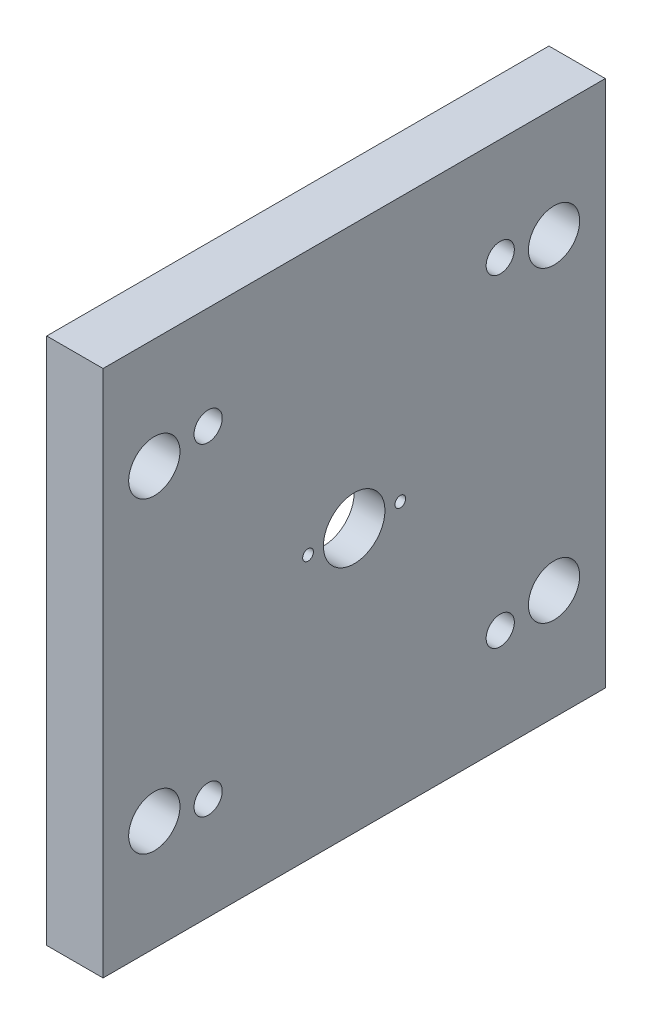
ISO-10303-21;
HEADER;
FILE_DESCRIPTION(('STEP AP214'),'2;1');
FILE_NAME('part.step','',(''),(''),'','','');
FILE_SCHEMA(('AUTOMOTIVE_DESIGN { 1 0 10303 214 1 1 1 1 }'));
ENDSEC;
DATA;
#1=APPLICATION_CONTEXT('core data for automotive mechanical design processes');
#2=APPLICATION_PROTOCOL_DEFINITION('international standard','automotive_design',2000,#1);
#3=PRODUCT_CONTEXT('',#1,'mechanical');
#4=PRODUCT('Part','Part','',(#3));
#5=PRODUCT_RELATED_PRODUCT_CATEGORY('part','',(#4));
#6=PRODUCT_DEFINITION_FORMATION('','',#4);
#7=PRODUCT_DEFINITION_CONTEXT('part definition',#1,'design');
#8=PRODUCT_DEFINITION('design','',#6,#7);
#9=PRODUCT_DEFINITION_SHAPE('','',#8);
#10=(LENGTH_UNIT() NAMED_UNIT(*) SI_UNIT(.MILLI.,.METRE.));
#11=(NAMED_UNIT(*) PLANE_ANGLE_UNIT() SI_UNIT($,.RADIAN.));
#12=(NAMED_UNIT(*) SI_UNIT($,.STERADIAN.) SOLID_ANGLE_UNIT());
#13=UNCERTAINTY_MEASURE_WITH_UNIT(LENGTH_MEASURE(1.E-05),#10,'distance_accuracy_value','');
#14=(GEOMETRIC_REPRESENTATION_CONTEXT(3) GLOBAL_UNCERTAINTY_ASSIGNED_CONTEXT((#13)) GLOBAL_UNIT_ASSIGNED_CONTEXT((#10,
#11,#12)) REPRESENTATION_CONTEXT('',''));
#15=CARTESIAN_POINT('',(0.,0.,0.));
#16=DIRECTION('',(0.,0.,1.));
#17=DIRECTION('',(1.,0.,0.));
#18=AXIS2_PLACEMENT_3D('',#15,#16,#17);
#19=CARTESIAN_POINT('',(0.,0.,0.));
#20=DIRECTION('',(-1.,0.,0.));
#21=DIRECTION('',(0.,0.,1.));
#22=AXIS2_PLACEMENT_3D('',#19,#20,#21);
#23=CYLINDRICAL_SURFACE('',#22,12.);
#24=CARTESIAN_POINT('',(0.,0.,0.));
#25=DIRECTION('',(-1.,0.,0.));
#26=DIRECTION('',(0.,0.,1.));
#27=AXIS2_PLACEMENT_3D('',#24,#25,#26);
#28=CIRCLE('',#27,12.);
#29=CARTESIAN_POINT('',(0.,0.,12.));
#30=VERTEX_POINT('',#29);
#31=EDGE_CURVE('E131',#30,#30,#28,.T.);
#32=ORIENTED_EDGE('',*,*,#31,.F.);
#33=EDGE_LOOP('',(#32));
#34=FACE_BOUND('',#33,.T.);
#35=CARTESIAN_POINT('',(-12.,0.,0.));
#36=DIRECTION('',(-1.,0.,0.));
#37=DIRECTION('',(0.,0.,1.));
#38=AXIS2_PLACEMENT_3D('',#35,#36,#37);
#39=CIRCLE('',#38,12.);
#40=CARTESIAN_POINT('',(-12.,0.,12.));
#41=VERTEX_POINT('',#40);
#42=EDGE_CURVE('E124',#41,#41,#39,.F.);
#43=ORIENTED_EDGE('',*,*,#42,.F.);
#44=EDGE_LOOP('',(#43));
#45=FACE_BOUND('',#44,.T.);
#46=ADVANCED_FACE('F42',(#34,#45),#23,.F.);
#47=CARTESIAN_POINT('',(0.,0.,0.));
#48=DIRECTION('',(1.,0.,0.));
#49=DIRECTION('',(0.,0.,-1.));
#50=AXIS2_PLACEMENT_3D('',#47,#48,#49);
#51=PLANE('',#50);
#52=CARTESIAN_POINT('',(0.,-0.000611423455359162,-17.9999999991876));
#53=DIRECTION('',(1.,0.,0.));
#54=DIRECTION('',(0.,0.,-1.));
#55=AXIS2_PLACEMENT_3D('',#52,#53,#54);
#56=CIRCLE('',#55,2.09999999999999);
#57=CARTESIAN_POINT('',(0.,-0.000611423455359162,-20.0999999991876));
#58=VERTEX_POINT('',#57);
#59=EDGE_CURVE('E142',#58,#58,#56,.T.);
#60=ORIENTED_EDGE('',*,*,#59,.F.);
#61=EDGE_LOOP('',(#60));
#62=FACE_BOUND('',#61,.T.);
#63=CARTESIAN_POINT('',(0.,0.00144159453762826,17.9999999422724));
#64=DIRECTION('',(1.,0.,0.));
#65=DIRECTION('',(0.,0.,-1.));
#66=AXIS2_PLACEMENT_3D('',#63,#64,#65);
#67=CIRCLE('',#66,2.09999999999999);
#68=CARTESIAN_POINT('',(0.,0.00144159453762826,15.8999999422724));
#69=VERTEX_POINT('',#68);
#70=EDGE_CURVE('E163',#69,#69,#67,.T.);
#71=ORIENTED_EDGE('',*,*,#70,.F.);
#72=EDGE_LOOP('',(#71));
#73=FACE_BOUND('',#72,.T.);
#74=ORIENTED_EDGE('',*,*,#31,.T.);
#75=EDGE_LOOP('',(#74));
#76=FACE_BOUND('',#75,.T.);
#77=DIRECTION('',(0.,0.,-1.));
#78=VECTOR('',#77,1.);
#79=CARTESIAN_POINT('',(0.,-103.,0.));
#80=LINE('',#79,#78);
#81=CARTESIAN_POINT('',(0.,-103.,98.));
#82=VERTEX_POINT('',#81);
#83=CARTESIAN_POINT('',(0.,-103.,-98.));
#84=VERTEX_POINT('',#83);
#85=EDGE_CURVE('E11',#82,#84,#80,.T.);
#86=ORIENTED_EDGE('',*,*,#85,.T.);
#87=DIRECTION('',(0.,-1.,0.));
#88=VECTOR('',#87,1.);
#89=CARTESIAN_POINT('',(0.,0.,-98.));
#90=LINE('',#89,#88);
#91=CARTESIAN_POINT('',(0.,103.,-98.));
#92=VERTEX_POINT('',#91);
#93=EDGE_CURVE('E62',#92,#84,#90,.T.);
#94=ORIENTED_EDGE('',*,*,#93,.F.);
#95=DIRECTION('',(0.,0.,-1.));
#96=VECTOR('',#95,1.);
#97=CARTESIAN_POINT('',(0.,103.,0.));
#98=LINE('',#97,#96);
#99=CARTESIAN_POINT('',(0.,103.,98.));
#100=VERTEX_POINT('',#99);
#101=EDGE_CURVE('E104',#100,#92,#98,.T.);
#102=ORIENTED_EDGE('',*,*,#101,.F.);
#103=DIRECTION('',(0.,1.,0.));
#104=VECTOR('',#103,1.);
#105=CARTESIAN_POINT('',(0.,0.,98.));
#106=LINE('',#105,#104);
#107=EDGE_CURVE('E91',#82,#100,#106,.T.);
#108=ORIENTED_EDGE('',*,*,#107,.F.);
#109=EDGE_LOOP('',(#86,#94,#102,#108));
#110=FACE_BOUND('',#109,.T.);
#111=CARTESIAN_POINT('',(0.,60.,-78.));
#112=DIRECTION('',(-1.,0.,0.));
#113=DIRECTION('',(0.,0.,-1.));
#114=AXIS2_PLACEMENT_3D('',#111,#112,#113);
#115=CIRCLE('',#114,10.);
#116=CARTESIAN_POINT('',(0.,60.,-88.));
#117=VERTEX_POINT('',#116);
#118=EDGE_CURVE('E53',#117,#117,#115,.T.);
#119=ORIENTED_EDGE('',*,*,#118,.T.);
#120=EDGE_LOOP('',(#119));
#121=FACE_BOUND('',#120,.T.);
#122=CARTESIAN_POINT('',(0.,60.,78.));
#123=DIRECTION('',(-1.,0.,0.));
#124=DIRECTION('',(0.,0.,-1.));
#125=AXIS2_PLACEMENT_3D('',#122,#123,#124);
#126=CIRCLE('',#125,10.);
#127=CARTESIAN_POINT('',(0.,60.,68.));
#128=VERTEX_POINT('',#127);
#129=EDGE_CURVE('E218',#128,#128,#126,.T.);
#130=ORIENTED_EDGE('',*,*,#129,.T.);
#131=EDGE_LOOP('',(#130));
#132=FACE_BOUND('',#131,.T.);
#133=CARTESIAN_POINT('',(0.,-60.,78.));
#134=DIRECTION('',(-1.,0.,0.));
#135=DIRECTION('',(0.,0.,-1.));
#136=AXIS2_PLACEMENT_3D('',#133,#134,#135);
#137=CIRCLE('',#136,10.);
#138=CARTESIAN_POINT('',(0.,-60.,68.));
#139=VERTEX_POINT('',#138);
#140=EDGE_CURVE('E178',#139,#139,#137,.T.);
#141=ORIENTED_EDGE('',*,*,#140,.T.);
#142=EDGE_LOOP('',(#141));
#143=FACE_BOUND('',#142,.T.);
#144=CARTESIAN_POINT('',(0.,-60.,-78.));
#145=DIRECTION('',(-1.,0.,0.));
#146=DIRECTION('',(0.,0.,-1.));
#147=AXIS2_PLACEMENT_3D('',#144,#145,#146);
#148=CIRCLE('',#147,10.);
#149=CARTESIAN_POINT('',(0.,-60.,-88.));
#150=VERTEX_POINT('',#149);
#151=EDGE_CURVE('E174',#150,#150,#148,.T.);
#152=ORIENTED_EDGE('',*,*,#151,.T.);
#153=EDGE_LOOP('',(#152));
#154=FACE_BOUND('',#153,.T.);
#155=CARTESIAN_POINT('',(0.,63.,-57.));
#156=DIRECTION('',(-1.,0.,0.));
#157=DIRECTION('',(0.,0.,-1.));
#158=AXIS2_PLACEMENT_3D('',#155,#156,#157);
#159=CIRCLE('',#158,5.5);
#160=CARTESIAN_POINT('',(0.,63.,-62.5));
#161=VERTEX_POINT('',#160);
#162=EDGE_CURVE('E179',#161,#161,#159,.T.);
#163=ORIENTED_EDGE('',*,*,#162,.T.);
#164=EDGE_LOOP('',(#163));
#165=FACE_BOUND('',#164,.T.);
#166=CARTESIAN_POINT('',(0.,63.,57.));
#167=DIRECTION('',(-1.,0.,0.));
#168=DIRECTION('',(0.,0.,-1.));
#169=AXIS2_PLACEMENT_3D('',#166,#167,#168);
#170=CIRCLE('',#169,5.5);
#171=CARTESIAN_POINT('',(0.,63.,51.5));
#172=VERTEX_POINT('',#171);
#173=EDGE_CURVE('E192',#172,#172,#170,.T.);
#174=ORIENTED_EDGE('',*,*,#173,.T.);
#175=EDGE_LOOP('',(#174));
#176=FACE_BOUND('',#175,.T.);
#177=CARTESIAN_POINT('',(0.,-63.,57.));
#178=DIRECTION('',(-1.,0.,0.));
#179=DIRECTION('',(0.,0.,-1.));
#180=AXIS2_PLACEMENT_3D('',#177,#178,#179);
#181=CIRCLE('',#180,5.5);
#182=CARTESIAN_POINT('',(0.,-63.,51.5));
#183=VERTEX_POINT('',#182);
#184=EDGE_CURVE('E256',#183,#183,#181,.T.);
#185=ORIENTED_EDGE('',*,*,#184,.T.);
#186=EDGE_LOOP('',(#185));
#187=FACE_BOUND('',#186,.T.);
#188=CARTESIAN_POINT('',(0.,-63.,-57.));
#189=DIRECTION('',(-1.,0.,0.));
#190=DIRECTION('',(0.,0.,-1.));
#191=AXIS2_PLACEMENT_3D('',#188,#189,#190);
#192=CIRCLE('',#191,5.5);
#193=CARTESIAN_POINT('',(0.,-63.,-62.5));
#194=VERTEX_POINT('',#193);
#195=EDGE_CURVE('E253',#194,#194,#192,.T.);
#196=ORIENTED_EDGE('',*,*,#195,.T.);
#197=EDGE_LOOP('',(#196));
#198=FACE_BOUND('',#197,.T.);
#199=ADVANCED_FACE('F284',(#62,#73,#76,#110,#121,#132,#143,#154,#165,#176,#187,#198),#51,.T.);
#200=CARTESIAN_POINT('',(-11.,103.,0.));
#201=DIRECTION('',(0.,1.,0.));
#202=DIRECTION('',(0.,0.,1.));
#203=AXIS2_PLACEMENT_3D('',#200,#201,#202);
#204=PLANE('',#203);
#205=ORIENTED_EDGE('',*,*,#101,.T.);
#206=DIRECTION('',(1.,0.,0.));
#207=VECTOR('',#206,1.);
#208=CARTESIAN_POINT('',(-11.,103.,-98.));
#209=LINE('',#208,#207);
#210=CARTESIAN_POINT('',(-22.,103.,-98.));
#211=VERTEX_POINT('',#210);
#212=EDGE_CURVE('E101',#211,#92,#209,.T.);
#213=ORIENTED_EDGE('',*,*,#212,.F.);
#214=DIRECTION('',(0.,0.,-1.));
#215=VECTOR('',#214,1.);
#216=CARTESIAN_POINT('',(-22.,103.,0.));
#217=LINE('',#216,#215);
#218=CARTESIAN_POINT('',(-22.,103.,98.));
#219=VERTEX_POINT('',#218);
#220=EDGE_CURVE('E99',#219,#211,#217,.T.);
#221=ORIENTED_EDGE('',*,*,#220,.F.);
#222=DIRECTION('',(-1.,0.,0.));
#223=VECTOR('',#222,1.);
#224=CARTESIAN_POINT('',(-11.,103.,98.));
#225=LINE('',#224,#223);
#226=EDGE_CURVE('E84',#100,#219,#225,.T.);
#227=ORIENTED_EDGE('',*,*,#226,.F.);
#228=EDGE_LOOP('',(#205,#213,#221,#227));
#229=FACE_BOUND('',#228,.T.);
#230=ADVANCED_FACE('F100',(#229),#204,.T.);
#231=CARTESIAN_POINT('',(-22.,0.,0.));
#232=DIRECTION('',(-1.,0.,0.));
#233=DIRECTION('',(0.,0.,1.));
#234=AXIS2_PLACEMENT_3D('',#231,#232,#233);
#235=PLANE('',#234);
#236=ORIENTED_EDGE('',*,*,#220,.T.);
#237=DIRECTION('',(0.,1.,0.));
#238=VECTOR('',#237,1.);
#239=CARTESIAN_POINT('',(-22.,0.,-98.));
#240=LINE('',#239,#238);
#241=CARTESIAN_POINT('',(-22.,-103.,-98.));
#242=VERTEX_POINT('',#241);
#243=EDGE_CURVE('E245',#242,#211,#240,.T.);
#244=ORIENTED_EDGE('',*,*,#243,.F.);
#245=DIRECTION('',(0.,0.,-1.));
#246=VECTOR('',#245,1.);
#247=CARTESIAN_POINT('',(-22.,-103.,0.));
#248=LINE('',#247,#246);
#249=CARTESIAN_POINT('',(-22.,-103.,98.));
#250=VERTEX_POINT('',#249);
#251=EDGE_CURVE('E111',#250,#242,#248,.T.);
#252=ORIENTED_EDGE('',*,*,#251,.F.);
#253=DIRECTION('',(0.,-1.,0.));
#254=VECTOR('',#253,1.);
#255=CARTESIAN_POINT('',(-22.,0.,98.));
#256=LINE('',#255,#254);
#257=EDGE_CURVE('E89',#219,#250,#256,.T.);
#258=ORIENTED_EDGE('',*,*,#257,.F.);
#259=EDGE_LOOP('',(#236,#244,#252,#258));
#260=FACE_BOUND('',#259,.T.);
#261=CARTESIAN_POINT('',(-22.,60.,-78.));
#262=DIRECTION('',(1.,0.,0.));
#263=DIRECTION('',(0.,0.,-1.));
#264=AXIS2_PLACEMENT_3D('',#261,#262,#263);
#265=CIRCLE('',#264,10.);
#266=CARTESIAN_POINT('',(-22.,60.,-88.));
#267=VERTEX_POINT('',#266);
#268=EDGE_CURVE('E105',#267,#267,#265,.T.);
#269=ORIENTED_EDGE('',*,*,#268,.T.);
#270=EDGE_LOOP('',(#269));
#271=FACE_BOUND('',#270,.T.);
#272=CARTESIAN_POINT('',(-22.,60.,78.));
#273=DIRECTION('',(1.,0.,0.));
#274=DIRECTION('',(0.,0.,-1.));
#275=AXIS2_PLACEMENT_3D('',#272,#273,#274);
#276=CIRCLE('',#275,10.);
#277=CARTESIAN_POINT('',(-22.,60.,68.));
#278=VERTEX_POINT('',#277);
#279=EDGE_CURVE('E187',#278,#278,#276,.T.);
#280=ORIENTED_EDGE('',*,*,#279,.T.);
#281=EDGE_LOOP('',(#280));
#282=FACE_BOUND('',#281,.T.);
#283=CARTESIAN_POINT('',(-22.,-60.,78.));
#284=DIRECTION('',(1.,0.,0.));
#285=DIRECTION('',(0.,0.,-1.));
#286=AXIS2_PLACEMENT_3D('',#283,#284,#285);
#287=CIRCLE('',#286,10.);
#288=CARTESIAN_POINT('',(-22.,-60.,68.));
#289=VERTEX_POINT('',#288);
#290=EDGE_CURVE('E214',#289,#289,#287,.T.);
#291=ORIENTED_EDGE('',*,*,#290,.T.);
#292=EDGE_LOOP('',(#291));
#293=FACE_BOUND('',#292,.T.);
#294=CARTESIAN_POINT('',(-22.,-60.,-78.));
#295=DIRECTION('',(1.,0.,0.));
#296=DIRECTION('',(0.,0.,-1.));
#297=AXIS2_PLACEMENT_3D('',#294,#295,#296);
#298=CIRCLE('',#297,10.);
#299=CARTESIAN_POINT('',(-22.,-60.,-88.));
#300=VERTEX_POINT('',#299);
#301=EDGE_CURVE('E207',#300,#300,#298,.T.);
#302=ORIENTED_EDGE('',*,*,#301,.T.);
#303=EDGE_LOOP('',(#302));
#304=FACE_BOUND('',#303,.T.);
#305=CARTESIAN_POINT('',(-22.,63.,-57.));
#306=DIRECTION('',(1.,0.,0.));
#307=DIRECTION('',(0.,0.,-1.));
#308=AXIS2_PLACEMENT_3D('',#305,#306,#307);
#309=CIRCLE('',#308,9.);
#310=CARTESIAN_POINT('',(-22.,63.,-66.));
#311=VERTEX_POINT('',#310);
#312=EDGE_CURVE('E203',#311,#311,#309,.T.);
#313=ORIENTED_EDGE('',*,*,#312,.T.);
#314=EDGE_LOOP('',(#313));
#315=FACE_BOUND('',#314,.T.);
#316=CARTESIAN_POINT('',(-22.,63.,57.));
#317=DIRECTION('',(1.,0.,0.));
#318=DIRECTION('',(0.,0.,-1.));
#319=AXIS2_PLACEMENT_3D('',#316,#317,#318);
#320=CIRCLE('',#319,9.);
#321=CARTESIAN_POINT('',(-22.,63.,48.));
#322=VERTEX_POINT('',#321);
#323=EDGE_CURVE('E199',#322,#322,#320,.T.);
#324=ORIENTED_EDGE('',*,*,#323,.T.);
#325=EDGE_LOOP('',(#324));
#326=FACE_BOUND('',#325,.T.);
#327=CARTESIAN_POINT('',(-22.,-63.,57.));
#328=DIRECTION('',(1.,0.,0.));
#329=DIRECTION('',(0.,0.,-1.));
#330=AXIS2_PLACEMENT_3D('',#327,#328,#329);
#331=CIRCLE('',#330,9.);
#332=CARTESIAN_POINT('',(-22.,-63.,48.));
#333=VERTEX_POINT('',#332);
#334=EDGE_CURVE('E197',#333,#333,#331,.T.);
#335=ORIENTED_EDGE('',*,*,#334,.T.);
#336=EDGE_LOOP('',(#335));
#337=FACE_BOUND('',#336,.T.);
#338=CARTESIAN_POINT('',(-22.,-63.,-57.));
#339=DIRECTION('',(1.,0.,0.));
#340=DIRECTION('',(0.,0.,-1.));
#341=AXIS2_PLACEMENT_3D('',#338,#339,#340);
#342=CIRCLE('',#341,9.);
#343=CARTESIAN_POINT('',(-22.,-63.,-66.));
#344=VERTEX_POINT('',#343);
#345=EDGE_CURVE('E193',#344,#344,#342,.T.);
#346=ORIENTED_EDGE('',*,*,#345,.T.);
#347=EDGE_LOOP('',(#346));
#348=FACE_BOUND('',#347,.T.);
#349=CARTESIAN_POINT('',(-22.,0.,0.));
#350=DIRECTION('',(1.,0.,0.));
#351=DIRECTION('',(0.,0.,-1.));
#352=AXIS2_PLACEMENT_3D('',#349,#350,#351);
#353=CIRCLE('',#352,45.);
#354=CARTESIAN_POINT('',(-22.,0.,-45.));
#355=VERTEX_POINT('',#354);
#356=EDGE_CURVE('E198',#355,#355,#353,.T.);
#357=ORIENTED_EDGE('',*,*,#356,.T.);
#358=EDGE_LOOP('',(#357));
#359=FACE_BOUND('',#358,.T.);
#360=ADVANCED_FACE('F108',(#260,#271,#282,#293,#304,#315,#326,#337,#348,#359),#235,.T.);
#361=CARTESIAN_POINT('',(-11.,-103.,0.));
#362=DIRECTION('',(0.,-1.,0.));
#363=DIRECTION('',(0.,0.,-1.));
#364=AXIS2_PLACEMENT_3D('',#361,#362,#363);
#365=PLANE('',#364);
#366=ORIENTED_EDGE('',*,*,#251,.T.);
#367=DIRECTION('',(-1.,0.,0.));
#368=VECTOR('',#367,1.);
#369=CARTESIAN_POINT('',(-11.,-103.,-98.));
#370=LINE('',#369,#368);
#371=EDGE_CURVE('E248',#84,#242,#370,.T.);
#372=ORIENTED_EDGE('',*,*,#371,.F.);
#373=ORIENTED_EDGE('',*,*,#85,.F.);
#374=DIRECTION('',(1.,0.,0.));
#375=VECTOR('',#374,1.);
#376=CARTESIAN_POINT('',(-11.,-103.,98.));
#377=LINE('',#376,#375);
#378=EDGE_CURVE('E113',#250,#82,#377,.T.);
#379=ORIENTED_EDGE('',*,*,#378,.F.);
#380=EDGE_LOOP('',(#366,#372,#373,#379));
#381=FACE_BOUND('',#380,.T.);
#382=ADVANCED_FACE('F332',(#381),#365,.T.);
#383=CARTESIAN_POINT('',(-11.,0.,-98.));
#384=DIRECTION('',(0.,0.,-1.));
#385=DIRECTION('',(-1.,0.,0.));
#386=AXIS2_PLACEMENT_3D('',#383,#384,#385);
#387=PLANE('',#386);
#388=ORIENTED_EDGE('',*,*,#93,.T.);
#389=ORIENTED_EDGE('',*,*,#371,.T.);
#390=ORIENTED_EDGE('',*,*,#243,.T.);
#391=ORIENTED_EDGE('',*,*,#212,.T.);
#392=EDGE_LOOP('',(#388,#389,#390,#391));
#393=FACE_BOUND('',#392,.T.);
#394=ADVANCED_FACE('F335',(#393),#387,.T.);
#395=CARTESIAN_POINT('',(-11.,0.,98.));
#396=DIRECTION('',(0.,0.,1.));
#397=DIRECTION('',(1.,0.,0.));
#398=AXIS2_PLACEMENT_3D('',#395,#396,#397);
#399=PLANE('',#398);
#400=ORIENTED_EDGE('',*,*,#107,.T.);
#401=ORIENTED_EDGE('',*,*,#226,.T.);
#402=ORIENTED_EDGE('',*,*,#257,.T.);
#403=ORIENTED_EDGE('',*,*,#378,.T.);
#404=EDGE_LOOP('',(#400,#401,#402,#403));
#405=FACE_BOUND('',#404,.T.);
#406=ADVANCED_FACE('F86',(#405),#399,.T.);
#407=CARTESIAN_POINT('',(-11.,60.,-78.));
#408=DIRECTION('',(-1.,0.,0.));
#409=DIRECTION('',(0.,0.,1.));
#410=AXIS2_PLACEMENT_3D('',#407,#408,#409);
#411=CYLINDRICAL_SURFACE('',#410,10.);
#412=ORIENTED_EDGE('',*,*,#118,.F.);
#413=EDGE_LOOP('',(#412));
#414=FACE_BOUND('',#413,.T.);
#415=ORIENTED_EDGE('',*,*,#268,.F.);
#416=EDGE_LOOP('',(#415));
#417=FACE_BOUND('',#416,.T.);
#418=ADVANCED_FACE('F340',(#414,#417),#411,.F.);
#419=CARTESIAN_POINT('',(-11.,60.,78.));
#420=DIRECTION('',(-1.,0.,0.));
#421=DIRECTION('',(0.,0.,1.));
#422=AXIS2_PLACEMENT_3D('',#419,#420,#421);
#423=CYLINDRICAL_SURFACE('',#422,10.);
#424=ORIENTED_EDGE('',*,*,#129,.F.);
#425=EDGE_LOOP('',(#424));
#426=FACE_BOUND('',#425,.T.);
#427=ORIENTED_EDGE('',*,*,#279,.F.);
#428=EDGE_LOOP('',(#427));
#429=FACE_BOUND('',#428,.T.);
#430=ADVANCED_FACE('F542',(#426,#429),#423,.F.);
#431=CARTESIAN_POINT('',(-11.,-60.,78.));
#432=DIRECTION('',(-1.,0.,0.));
#433=DIRECTION('',(0.,0.,1.));
#434=AXIS2_PLACEMENT_3D('',#431,#432,#433);
#435=CYLINDRICAL_SURFACE('',#434,10.);
#436=ORIENTED_EDGE('',*,*,#140,.F.);
#437=EDGE_LOOP('',(#436));
#438=FACE_BOUND('',#437,.T.);
#439=ORIENTED_EDGE('',*,*,#290,.F.);
#440=EDGE_LOOP('',(#439));
#441=FACE_BOUND('',#440,.T.);
#442=ADVANCED_FACE('F360',(#438,#441),#435,.F.);
#443=CARTESIAN_POINT('',(-11.,-60.,-78.));
#444=DIRECTION('',(-1.,0.,0.));
#445=DIRECTION('',(0.,0.,1.));
#446=AXIS2_PLACEMENT_3D('',#443,#444,#445);
#447=CYLINDRICAL_SURFACE('',#446,10.);
#448=ORIENTED_EDGE('',*,*,#151,.F.);
#449=EDGE_LOOP('',(#448));
#450=FACE_BOUND('',#449,.T.);
#451=ORIENTED_EDGE('',*,*,#301,.F.);
#452=EDGE_LOOP('',(#451));
#453=FACE_BOUND('',#452,.T.);
#454=ADVANCED_FACE('F354',(#450,#453),#447,.F.);
#455=CARTESIAN_POINT('',(-11.,63.,-57.));
#456=DIRECTION('',(-1.,0.,0.));
#457=DIRECTION('',(0.,0.,1.));
#458=AXIS2_PLACEMENT_3D('',#455,#456,#457);
#459=CYLINDRICAL_SURFACE('',#458,5.5);
#460=ORIENTED_EDGE('',*,*,#162,.F.);
#461=EDGE_LOOP('',(#460));
#462=FACE_BOUND('',#461,.T.);
#463=CARTESIAN_POINT('',(-9.,63.,-57.));
#464=DIRECTION('',(-1.,0.,0.));
#465=DIRECTION('',(0.,0.,-1.));
#466=AXIS2_PLACEMENT_3D('',#463,#464,#465);
#467=CIRCLE('',#466,5.5);
#468=CARTESIAN_POINT('',(-9.,63.,-62.5));
#469=VERTEX_POINT('',#468);
#470=EDGE_CURVE('E173',#469,#469,#467,.T.);
#471=ORIENTED_EDGE('',*,*,#470,.T.);
#472=EDGE_LOOP('',(#471));
#473=FACE_BOUND('',#472,.T.);
#474=ADVANCED_FACE('F291',(#462,#473),#459,.F.);
#475=CARTESIAN_POINT('',(-11.,63.,57.));
#476=DIRECTION('',(-1.,0.,0.));
#477=DIRECTION('',(0.,0.,1.));
#478=AXIS2_PLACEMENT_3D('',#475,#476,#477);
#479=CYLINDRICAL_SURFACE('',#478,5.5);
#480=ORIENTED_EDGE('',*,*,#173,.F.);
#481=EDGE_LOOP('',(#480));
#482=FACE_BOUND('',#481,.T.);
#483=CARTESIAN_POINT('',(-9.,63.,57.));
#484=DIRECTION('',(-1.,0.,0.));
#485=DIRECTION('',(0.,0.,-1.));
#486=AXIS2_PLACEMENT_3D('',#483,#484,#485);
#487=CIRCLE('',#486,5.5);
#488=CARTESIAN_POINT('',(-9.,63.,51.5));
#489=VERTEX_POINT('',#488);
#490=EDGE_CURVE('E180',#489,#489,#487,.T.);
#491=ORIENTED_EDGE('',*,*,#490,.T.);
#492=EDGE_LOOP('',(#491));
#493=FACE_BOUND('',#492,.T.);
#494=ADVANCED_FACE('F287',(#482,#493),#479,.F.);
#495=CARTESIAN_POINT('',(-11.,-63.,57.));
#496=DIRECTION('',(-1.,0.,0.));
#497=DIRECTION('',(0.,0.,1.));
#498=AXIS2_PLACEMENT_3D('',#495,#496,#497);
#499=CYLINDRICAL_SURFACE('',#498,5.5);
#500=ORIENTED_EDGE('',*,*,#184,.F.);
#501=EDGE_LOOP('',(#500));
#502=FACE_BOUND('',#501,.T.);
#503=CARTESIAN_POINT('',(-9.,-63.,57.));
#504=DIRECTION('',(-1.,0.,0.));
#505=DIRECTION('',(0.,0.,-1.));
#506=AXIS2_PLACEMENT_3D('',#503,#504,#505);
#507=CIRCLE('',#506,5.5);
#508=CARTESIAN_POINT('',(-9.,-63.,51.5));
#509=VERTEX_POINT('',#508);
#510=EDGE_CURVE('E118',#509,#509,#507,.T.);
#511=ORIENTED_EDGE('',*,*,#510,.T.);
#512=EDGE_LOOP('',(#511));
#513=FACE_BOUND('',#512,.T.);
#514=ADVANCED_FACE('F290',(#502,#513),#499,.F.);
#515=CARTESIAN_POINT('',(-11.,-63.,-57.));
#516=DIRECTION('',(-1.,0.,0.));
#517=DIRECTION('',(0.,0.,1.));
#518=AXIS2_PLACEMENT_3D('',#515,#516,#517);
#519=CYLINDRICAL_SURFACE('',#518,5.5);
#520=ORIENTED_EDGE('',*,*,#195,.F.);
#521=EDGE_LOOP('',(#520));
#522=FACE_BOUND('',#521,.T.);
#523=CARTESIAN_POINT('',(-9.,-63.,-57.));
#524=DIRECTION('',(-1.,0.,0.));
#525=DIRECTION('',(0.,0.,-1.));
#526=AXIS2_PLACEMENT_3D('',#523,#524,#525);
#527=CIRCLE('',#526,5.5);
#528=CARTESIAN_POINT('',(-9.,-63.,-62.5));
#529=VERTEX_POINT('',#528);
#530=EDGE_CURVE('E184',#529,#529,#527,.T.);
#531=ORIENTED_EDGE('',*,*,#530,.T.);
#532=EDGE_LOOP('',(#531));
#533=FACE_BOUND('',#532,.T.);
#534=ADVANCED_FACE('F342',(#522,#533),#519,.F.);
#535=CARTESIAN_POINT('',(-9.,63.,-57.));
#536=DIRECTION('',(-1.,0.,0.));
#537=DIRECTION('',(0.,0.,1.));
#538=AXIS2_PLACEMENT_3D('',#535,#536,#537);
#539=PLANE('',#538);
#540=CARTESIAN_POINT('',(-9.,63.,-57.));
#541=DIRECTION('',(1.,0.,0.));
#542=DIRECTION('',(0.,0.,-1.));
#543=AXIS2_PLACEMENT_3D('',#540,#541,#542);
#544=CIRCLE('',#543,9.);
#545=CARTESIAN_POINT('',(-9.,63.,-66.));
#546=VERTEX_POINT('',#545);
#547=EDGE_CURVE('E230',#546,#546,#544,.T.);
#548=ORIENTED_EDGE('',*,*,#547,.F.);
#549=EDGE_LOOP('',(#548));
#550=FACE_BOUND('',#549,.T.);
#551=ORIENTED_EDGE('',*,*,#470,.F.);
#552=EDGE_LOOP('',(#551));
#553=FACE_BOUND('',#552,.T.);
#554=ADVANCED_FACE('F308',(#550,#553),#539,.T.);
#555=CARTESIAN_POINT('',(-15.5,63.,-57.));
#556=DIRECTION('',(-1.,0.,0.));
#557=DIRECTION('',(0.,0.,1.));
#558=AXIS2_PLACEMENT_3D('',#555,#556,#557);
#559=CYLINDRICAL_SURFACE('',#558,9.);
#560=ORIENTED_EDGE('',*,*,#547,.T.);
#561=EDGE_LOOP('',(#560));
#562=FACE_BOUND('',#561,.T.);
#563=ORIENTED_EDGE('',*,*,#312,.F.);
#564=EDGE_LOOP('',(#563));
#565=FACE_BOUND('',#564,.T.);
#566=ADVANCED_FACE('F298',(#562,#565),#559,.F.);
#567=CARTESIAN_POINT('',(-9.,63.,57.));
#568=DIRECTION('',(-1.,0.,0.));
#569=DIRECTION('',(0.,0.,1.));
#570=AXIS2_PLACEMENT_3D('',#567,#568,#569);
#571=PLANE('',#570);
#572=CARTESIAN_POINT('',(-9.,63.,57.));
#573=DIRECTION('',(1.,0.,0.));
#574=DIRECTION('',(0.,0.,-1.));
#575=AXIS2_PLACEMENT_3D('',#572,#573,#574);
#576=CIRCLE('',#575,9.);
#577=CARTESIAN_POINT('',(-9.,63.,48.));
#578=VERTEX_POINT('',#577);
#579=EDGE_CURVE('E226',#578,#578,#576,.T.);
#580=ORIENTED_EDGE('',*,*,#579,.F.);
#581=EDGE_LOOP('',(#580));
#582=FACE_BOUND('',#581,.T.);
#583=ORIENTED_EDGE('',*,*,#490,.F.);
#584=EDGE_LOOP('',(#583));
#585=FACE_BOUND('',#584,.T.);
#586=ADVANCED_FACE('F295',(#582,#585),#571,.T.);
#587=CARTESIAN_POINT('',(-15.5,63.,57.));
#588=DIRECTION('',(-1.,0.,0.));
#589=DIRECTION('',(0.,0.,1.));
#590=AXIS2_PLACEMENT_3D('',#587,#588,#589);
#591=CYLINDRICAL_SURFACE('',#590,9.);
#592=ORIENTED_EDGE('',*,*,#579,.T.);
#593=EDGE_LOOP('',(#592));
#594=FACE_BOUND('',#593,.T.);
#595=ORIENTED_EDGE('',*,*,#323,.F.);
#596=EDGE_LOOP('',(#595));
#597=FACE_BOUND('',#596,.T.);
#598=ADVANCED_FACE('F297',(#594,#597),#591,.F.);
#599=CARTESIAN_POINT('',(-9.,-63.,57.));
#600=DIRECTION('',(-1.,0.,0.));
#601=DIRECTION('',(0.,0.,1.));
#602=AXIS2_PLACEMENT_3D('',#599,#600,#601);
#603=PLANE('',#602);
#604=CARTESIAN_POINT('',(-9.,-63.,57.));
#605=DIRECTION('',(1.,0.,0.));
#606=DIRECTION('',(0.,0.,-1.));
#607=AXIS2_PLACEMENT_3D('',#604,#605,#606);
#608=CIRCLE('',#607,9.);
#609=CARTESIAN_POINT('',(-9.,-63.,48.));
#610=VERTEX_POINT('',#609);
#611=EDGE_CURVE('E231',#610,#610,#608,.T.);
#612=ORIENTED_EDGE('',*,*,#611,.F.);
#613=EDGE_LOOP('',(#612));
#614=FACE_BOUND('',#613,.T.);
#615=ORIENTED_EDGE('',*,*,#510,.F.);
#616=EDGE_LOOP('',(#615));
#617=FACE_BOUND('',#616,.T.);
#618=ADVANCED_FACE('F305',(#614,#617),#603,.T.);
#619=CARTESIAN_POINT('',(-15.5,-63.,57.));
#620=DIRECTION('',(-1.,0.,0.));
#621=DIRECTION('',(0.,0.,1.));
#622=AXIS2_PLACEMENT_3D('',#619,#620,#621);
#623=CYLINDRICAL_SURFACE('',#622,9.);
#624=ORIENTED_EDGE('',*,*,#611,.T.);
#625=EDGE_LOOP('',(#624));
#626=FACE_BOUND('',#625,.T.);
#627=ORIENTED_EDGE('',*,*,#334,.F.);
#628=EDGE_LOOP('',(#627));
#629=FACE_BOUND('',#628,.T.);
#630=ADVANCED_FACE('F369',(#626,#629),#623,.F.);
#631=CARTESIAN_POINT('',(-9.,-63.,-57.));
#632=DIRECTION('',(-1.,0.,0.));
#633=DIRECTION('',(0.,0.,1.));
#634=AXIS2_PLACEMENT_3D('',#631,#632,#633);
#635=PLANE('',#634);
#636=CARTESIAN_POINT('',(-9.,-63.,-57.));
#637=DIRECTION('',(1.,0.,0.));
#638=DIRECTION('',(0.,0.,-1.));
#639=AXIS2_PLACEMENT_3D('',#636,#637,#638);
#640=CIRCLE('',#639,9.);
#641=CARTESIAN_POINT('',(-9.,-63.,-66.));
#642=VERTEX_POINT('',#641);
#643=EDGE_CURVE('E235',#642,#642,#640,.T.);
#644=ORIENTED_EDGE('',*,*,#643,.F.);
#645=EDGE_LOOP('',(#644));
#646=FACE_BOUND('',#645,.T.);
#647=ORIENTED_EDGE('',*,*,#530,.F.);
#648=EDGE_LOOP('',(#647));
#649=FACE_BOUND('',#648,.T.);
#650=ADVANCED_FACE('F371',(#646,#649),#635,.T.);
#651=CARTESIAN_POINT('',(-15.5,-63.,-57.));
#652=DIRECTION('',(-1.,0.,0.));
#653=DIRECTION('',(0.,0.,1.));
#654=AXIS2_PLACEMENT_3D('',#651,#652,#653);
#655=CYLINDRICAL_SURFACE('',#654,9.);
#656=ORIENTED_EDGE('',*,*,#643,.T.);
#657=EDGE_LOOP('',(#656));
#658=FACE_BOUND('',#657,.T.);
#659=ORIENTED_EDGE('',*,*,#345,.F.);
#660=EDGE_LOOP('',(#659));
#661=FACE_BOUND('',#660,.T.);
#662=ADVANCED_FACE('F373',(#658,#661),#655,.F.);
#663=CARTESIAN_POINT('',(-17.95,0.,0.));
#664=DIRECTION('',(-1.,0.,0.));
#665=DIRECTION('',(0.,0.,1.));
#666=AXIS2_PLACEMENT_3D('',#663,#664,#665);
#667=PLANE('',#666);
#668=CARTESIAN_POINT('',(-17.95,0.,-40.));
#669=DIRECTION('',(-1.,0.,0.));
#670=DIRECTION('',(0.,0.,1.));
#671=AXIS2_PLACEMENT_3D('',#668,#669,#670);
#672=CIRCLE('',#671,2.09999999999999);
#673=CARTESIAN_POINT('',(-17.95,0.,-37.9));
#674=VERTEX_POINT('',#673);
#675=EDGE_CURVE('E46',#674,#674,#672,.T.);
#676=ORIENTED_EDGE('',*,*,#675,.F.);
#677=EDGE_LOOP('',(#676));
#678=FACE_BOUND('',#677,.T.);
#679=CARTESIAN_POINT('',(-17.95,0.,40.));
#680=DIRECTION('',(-1.,0.,0.));
#681=DIRECTION('',(0.,0.,1.));
#682=AXIS2_PLACEMENT_3D('',#679,#680,#681);
#683=CIRCLE('',#682,2.09999999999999);
#684=CARTESIAN_POINT('',(-17.95,0.,42.1));
#685=VERTEX_POINT('',#684);
#686=EDGE_CURVE('E132',#685,#685,#683,.T.);
#687=ORIENTED_EDGE('',*,*,#686,.F.);
#688=EDGE_LOOP('',(#687));
#689=FACE_BOUND('',#688,.T.);
#690=CARTESIAN_POINT('',(-17.95,0.,0.));
#691=DIRECTION('',(-1.,0.,0.));
#692=DIRECTION('',(0.,0.,1.));
#693=AXIS2_PLACEMENT_3D('',#690,#691,#692);
#694=CIRCLE('',#693,25.);
#695=CARTESIAN_POINT('',(-17.95,0.,25.));
#696=VERTEX_POINT('',#695);
#697=EDGE_CURVE('E128',#696,#696,#694,.T.);
#698=ORIENTED_EDGE('',*,*,#697,.F.);
#699=EDGE_LOOP('',(#698));
#700=FACE_BOUND('',#699,.T.);
#701=CARTESIAN_POINT('',(-17.95,0.,0.));
#702=DIRECTION('',(1.,0.,0.));
#703=DIRECTION('',(0.,0.,-1.));
#704=AXIS2_PLACEMENT_3D('',#701,#702,#703);
#705=CIRCLE('',#704,45.);
#706=CARTESIAN_POINT('',(-17.95,0.,-45.));
#707=VERTEX_POINT('',#706);
#708=EDGE_CURVE('E242',#707,#707,#705,.T.);
#709=ORIENTED_EDGE('',*,*,#708,.F.);
#710=EDGE_LOOP('',(#709));
#711=FACE_BOUND('',#710,.T.);
#712=ADVANCED_FACE('F375',(#678,#689,#700,#711),#667,.T.);
#713=CARTESIAN_POINT('',(-19.975,0.,0.));
#714=DIRECTION('',(-1.,0.,0.));
#715=DIRECTION('',(0.,0.,1.));
#716=AXIS2_PLACEMENT_3D('',#713,#714,#715);
#717=CYLINDRICAL_SURFACE('',#716,45.);
#718=ORIENTED_EDGE('',*,*,#708,.T.);
#719=EDGE_LOOP('',(#718));
#720=FACE_BOUND('',#719,.T.);
#721=ORIENTED_EDGE('',*,*,#356,.F.);
#722=EDGE_LOOP('',(#721));
#723=FACE_BOUND('',#722,.T.);
#724=ADVANCED_FACE('F44',(#720,#723),#717,.F.);
#725=CARTESIAN_POINT('',(-12.,0.,0.));
#726=DIRECTION('',(-1.,0.,0.));
#727=DIRECTION('',(0.,0.,1.));
#728=AXIS2_PLACEMENT_3D('',#725,#726,#727);
#729=PLANE('',#728);
#730=CARTESIAN_POINT('',(-12.,-0.000611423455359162,-17.9999999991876));
#731=DIRECTION('',(-1.,0.,0.));
#732=DIRECTION('',(0.,0.,1.));
#733=AXIS2_PLACEMENT_3D('',#730,#731,#732);
#734=CIRCLE('',#733,2.09999999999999);
#735=CARTESIAN_POINT('',(-12.,-0.000611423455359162,-15.8999999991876));
#736=VERTEX_POINT('',#735);
#737=EDGE_CURVE('E135',#736,#736,#734,.T.);
#738=ORIENTED_EDGE('',*,*,#737,.F.);
#739=EDGE_LOOP('',(#738));
#740=FACE_BOUND('',#739,.T.);
#741=CARTESIAN_POINT('',(-12.,0.00144159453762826,17.9999999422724));
#742=DIRECTION('',(-1.,0.,0.));
#743=DIRECTION('',(0.,0.,1.));
#744=AXIS2_PLACEMENT_3D('',#741,#742,#743);
#745=CIRCLE('',#744,2.09999999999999);
#746=CARTESIAN_POINT('',(-12.,0.00144159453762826,20.0999999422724));
#747=VERTEX_POINT('',#746);
#748=EDGE_CURVE('E159',#747,#747,#745,.T.);
#749=ORIENTED_EDGE('',*,*,#748,.F.);
#750=EDGE_LOOP('',(#749));
#751=FACE_BOUND('',#750,.T.);
#752=CARTESIAN_POINT('',(-12.,0.,0.));
#753=DIRECTION('',(-1.,0.,0.));
#754=DIRECTION('',(0.,0.,1.));
#755=AXIS2_PLACEMENT_3D('',#752,#753,#754);
#756=CIRCLE('',#755,25.);
#757=CARTESIAN_POINT('',(-12.,0.,25.));
#758=VERTEX_POINT('',#757);
#759=EDGE_CURVE('E129',#758,#758,#756,.T.);
#760=ORIENTED_EDGE('',*,*,#759,.T.);
#761=EDGE_LOOP('',(#760));
#762=FACE_BOUND('',#761,.T.);
#763=ORIENTED_EDGE('',*,*,#42,.T.);
#764=EDGE_LOOP('',(#763));
#765=FACE_BOUND('',#764,.T.);
#766=ADVANCED_FACE('F393',(#740,#751,#762,#765),#729,.T.);
#767=CARTESIAN_POINT('',(-12.,0.,0.));
#768=DIRECTION('',(-1.,0.,0.));
#769=DIRECTION('',(0.,0.,1.));
#770=AXIS2_PLACEMENT_3D('',#767,#768,#769);
#771=CYLINDRICAL_SURFACE('',#770,25.);
#772=ORIENTED_EDGE('',*,*,#697,.T.);
#773=EDGE_LOOP('',(#772));
#774=FACE_BOUND('',#773,.T.);
#775=ORIENTED_EDGE('',*,*,#759,.F.);
#776=EDGE_LOOP('',(#775));
#777=FACE_BOUND('',#776,.T.);
#778=ADVANCED_FACE('F325',(#774,#777),#771,.F.);
#779=CARTESIAN_POINT('',(-12.,0.00144159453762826,17.9999999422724));
#780=DIRECTION('',(-1.,0.,0.));
#781=DIRECTION('',(0.,0.,1.));
#782=AXIS2_PLACEMENT_3D('',#779,#780,#781);
#783=CYLINDRICAL_SURFACE('',#782,2.09999999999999);
#784=ORIENTED_EDGE('',*,*,#70,.T.);
#785=EDGE_LOOP('',(#784));
#786=FACE_BOUND('',#785,.T.);
#787=ORIENTED_EDGE('',*,*,#748,.T.);
#788=EDGE_LOOP('',(#787));
#789=FACE_BOUND('',#788,.T.);
#790=ADVANCED_FACE('F404',(#786,#789),#783,.F.);
#791=CARTESIAN_POINT('',(-12.,-0.000611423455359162,-17.9999999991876));
#792=DIRECTION('',(-1.,0.,0.));
#793=DIRECTION('',(0.,0.,1.));
#794=AXIS2_PLACEMENT_3D('',#791,#792,#793);
#795=CYLINDRICAL_SURFACE('',#794,2.09999999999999);
#796=ORIENTED_EDGE('',*,*,#59,.T.);
#797=EDGE_LOOP('',(#796));
#798=FACE_BOUND('',#797,.T.);
#799=ORIENTED_EDGE('',*,*,#737,.T.);
#800=EDGE_LOOP('',(#799));
#801=FACE_BOUND('',#800,.T.);
#802=ADVANCED_FACE('F411',(#798,#801),#795,.F.);
#803=CARTESIAN_POINT('',(-8.,0.,40.));
#804=DIRECTION('',(-1.,0.,0.));
#805=DIRECTION('',(0.,0.,1.));
#806=AXIS2_PLACEMENT_3D('',#803,#804,#805);
#807=CONICAL_SURFACE('',#806,2.09999999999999,1.02974425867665);
#808=CARTESIAN_POINT('',(-6.73819270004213,0.,40.));
#809=VERTEX_POINT('',#808);
#810=VERTEX_LOOP('',#809);
#811=FACE_BOUND('',#810,.T.);
#812=CARTESIAN_POINT('',(-8.,0.,40.));
#813=DIRECTION('',(-1.,0.,0.));
#814=DIRECTION('',(0.,0.,1.));
#815=AXIS2_PLACEMENT_3D('',#812,#813,#814);
#816=CIRCLE('',#815,2.09999999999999);
#817=CARTESIAN_POINT('',(-8.,0.,42.1));
#818=VERTEX_POINT('',#817);
#819=EDGE_CURVE('E136',#818,#818,#816,.T.);
#820=ORIENTED_EDGE('',*,*,#819,.T.);
#821=EDGE_LOOP('',(#820));
#822=FACE_BOUND('',#821,.T.);
#823=ADVANCED_FACE('F415',(#811,#822),#807,.F.);
#824=CARTESIAN_POINT('',(-22.,0.,40.));
#825=DIRECTION('',(-1.,0.,0.));
#826=DIRECTION('',(0.,0.,1.));
#827=AXIS2_PLACEMENT_3D('',#824,#825,#826);
#828=CYLINDRICAL_SURFACE('',#827,2.09999999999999);
#829=ORIENTED_EDGE('',*,*,#686,.T.);
#830=EDGE_LOOP('',(#829));
#831=FACE_BOUND('',#830,.T.);
#832=ORIENTED_EDGE('',*,*,#819,.F.);
#833=EDGE_LOOP('',(#832));
#834=FACE_BOUND('',#833,.T.);
#835=ADVANCED_FACE('F419',(#831,#834),#828,.F.);
#836=CARTESIAN_POINT('',(-8.,0.,-40.));
#837=DIRECTION('',(-1.,0.,0.));
#838=DIRECTION('',(0.,0.,1.));
#839=AXIS2_PLACEMENT_3D('',#836,#837,#838);
#840=CONICAL_SURFACE('',#839,2.09999999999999,1.02974425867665);
#841=CARTESIAN_POINT('',(-6.73819270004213,0.,-40.));
#842=VERTEX_POINT('',#841);
#843=VERTEX_LOOP('',#842);
#844=FACE_BOUND('',#843,.T.);
#845=CARTESIAN_POINT('',(-8.,0.,-40.));
#846=DIRECTION('',(-1.,0.,0.));
#847=DIRECTION('',(0.,0.,1.));
#848=AXIS2_PLACEMENT_3D('',#845,#846,#847);
#849=CIRCLE('',#848,2.09999999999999);
#850=CARTESIAN_POINT('',(-8.,0.,-37.9));
#851=VERTEX_POINT('',#850);
#852=EDGE_CURVE('E153',#851,#851,#849,.T.);
#853=ORIENTED_EDGE('',*,*,#852,.T.);
#854=EDGE_LOOP('',(#853));
#855=FACE_BOUND('',#854,.T.);
#856=ADVANCED_FACE('F423',(#844,#855),#840,.F.);
#857=CARTESIAN_POINT('',(-22.,0.,-40.));
#858=DIRECTION('',(-1.,0.,0.));
#859=DIRECTION('',(0.,0.,1.));
#860=AXIS2_PLACEMENT_3D('',#857,#858,#859);
#861=CYLINDRICAL_SURFACE('',#860,2.09999999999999);
#862=ORIENTED_EDGE('',*,*,#675,.T.);
#863=EDGE_LOOP('',(#862));
#864=FACE_BOUND('',#863,.T.);
#865=ORIENTED_EDGE('',*,*,#852,.F.);
#866=EDGE_LOOP('',(#865));
#867=FACE_BOUND('',#866,.T.);
#868=ADVANCED_FACE('F426',(#864,#867),#861,.F.);
#869=CLOSED_SHELL('',(#46,#199,#230,#360,#382,#394,#406,#418,#430,#442,#454,#474,#494,#514,#534,
#554,#566,#586,#598,#618,#630,#650,#662,#712,#724,#766,#778,#790,#802,#823,#835,#856,#868));
#870=MANIFOLD_SOLID_BREP('B2',#869);
#871=ADVANCED_BREP_SHAPE_REPRESENTATION('',(#18,#870),#14);
#872=SHAPE_DEFINITION_REPRESENTATION(#9,#871);
ENDSEC;
END-ISO-10303-21;
